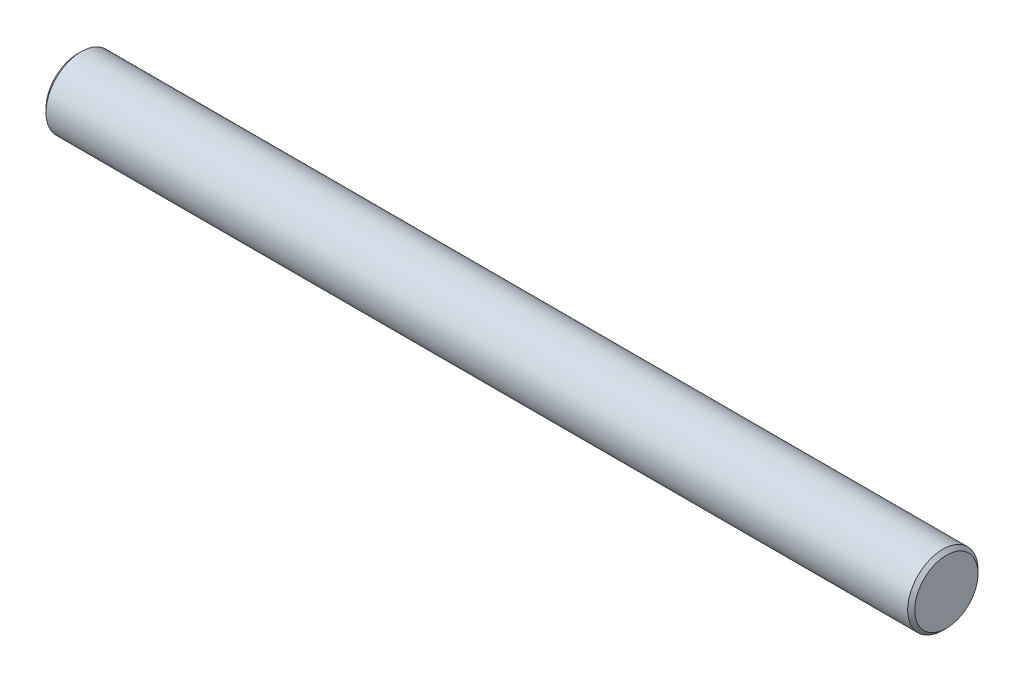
from build123d import *

# Parameters (mm, degrees)
SKETCH1_R      = 10
EXTRUDE1_DEPTH = 247
CHAMFER1_SIZE  = 1


with BuildPart() as part:
    # Sketch1 → Extrude1 (new body)
    with BuildSketch(Plane(origin=(0, 0, 0), x_dir=(0, 0, -1), z_dir=(1, 0, 0))):
        Circle(SKETCH1_R)
    extrude(amount=EXTRUDE1_DEPTH)

    # Chamfer1
    chamfer1_edges = [part.edges().sort_by_distance(p)[0] for p in [
        (0, 0, 10),
        (247, 0, 10),
    ]]
    chamfer(chamfer1_edges, length=CHAMFER1_SIZE)


solid = part.part
